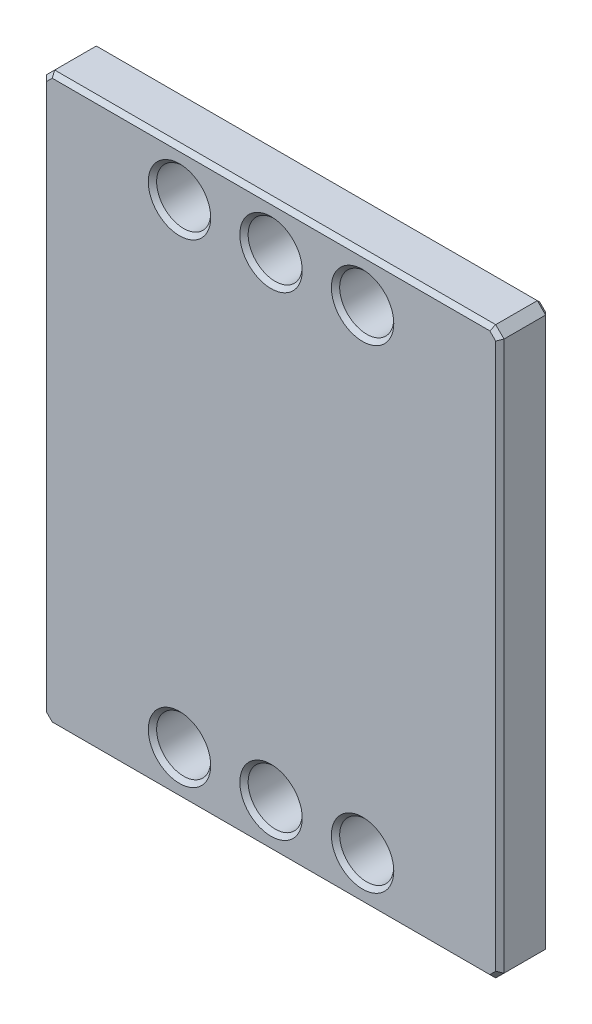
from build123d import *

# Parameters (mm, degrees)
ESQUISSE1_W        = 55
ESQUISSE1_H        = 68
ESQUISSE1_R        = 3.25
BOSS_EXTRU_1_DEPTH = 6
CHANFREIN1_SIZE    = 1
CHANFREIN2_SIZE    = 0.5


with BuildPart() as part:
    # Esquisse1 → Boss.-Extru.1 (new body)
    with BuildSketch(Plane.XY):
        with Locations((0, 34)):
            Rectangle(ESQUISSE1_W, ESQUISSE1_H)
        with Locations((-11, 62.5)):
            Circle(ESQUISSE1_R, mode=Mode.SUBTRACT)
        with Locations((0, 62.5)):
            Circle(ESQUISSE1_R, mode=Mode.SUBTRACT)
        with Locations((11, 62.5)):
            Circle(ESQUISSE1_R, mode=Mode.SUBTRACT)
        with Locations((0, 5.5)):
            Circle(ESQUISSE1_R, mode=Mode.SUBTRACT)
        with Locations((11, 5.5)):
            Circle(ESQUISSE1_R, mode=Mode.SUBTRACT)
        with Locations((-11, 5.5)):
            Circle(ESQUISSE1_R, mode=Mode.SUBTRACT)
    extrude(amount=BOSS_EXTRU_1_DEPTH)

    # Chanfrein1
    chanfrein1_edges = [part.edges().sort_by_distance(p)[0] for p in [
        (-27.5, 68, 3),
        (27.5, 68, 3),
        (27.5, 0, 3),
        (-27.5, 0, 3),
    ]]
    chamfer(chanfrein1_edges, length=CHANFREIN1_SIZE)

    # Chanfrein2
    chanfrein2_edges = [part.edges().sort_by_distance(p)[0] for p in [
        (-14.25, 62.5, 0),
        (-14.25, 62.5, 6),
        (-3.25, 62.5, 0),
        (-3.25, 62.5, 6),
        (7.75, 62.5, 0),
        (7.75, 62.5, 6),
        (-3.25, 5.5, 0),
        (-3.25, 5.5, 6),
        (7.75, 5.5, 0),
        (7.75, 5.5, 6),
        (-14.25, 5.5, 0),
        (-14.25, 5.5, 6),
        (27.5, 34, 0),
        (27.5, 34, 6),
        (-27.5, 34, 0),
        (0, 68, 0),
        (0, 0, 0),
        (-27, 67.5, 0),
        (27, 67.5, 0),
        (-27, 0.5, 0),
        (27, 0.5, 0),
        (0, 0, 6),
        (-27.5, 34, 6),
        (0, 68, 6),
        (-27, 67.5, 6),
        (27, 67.5, 6),
        (-27, 0.5, 6),
        (27, 0.5, 6),
    ]]
    chamfer(chanfrein2_edges, length=CHANFREIN2_SIZE)


solid = part.part
